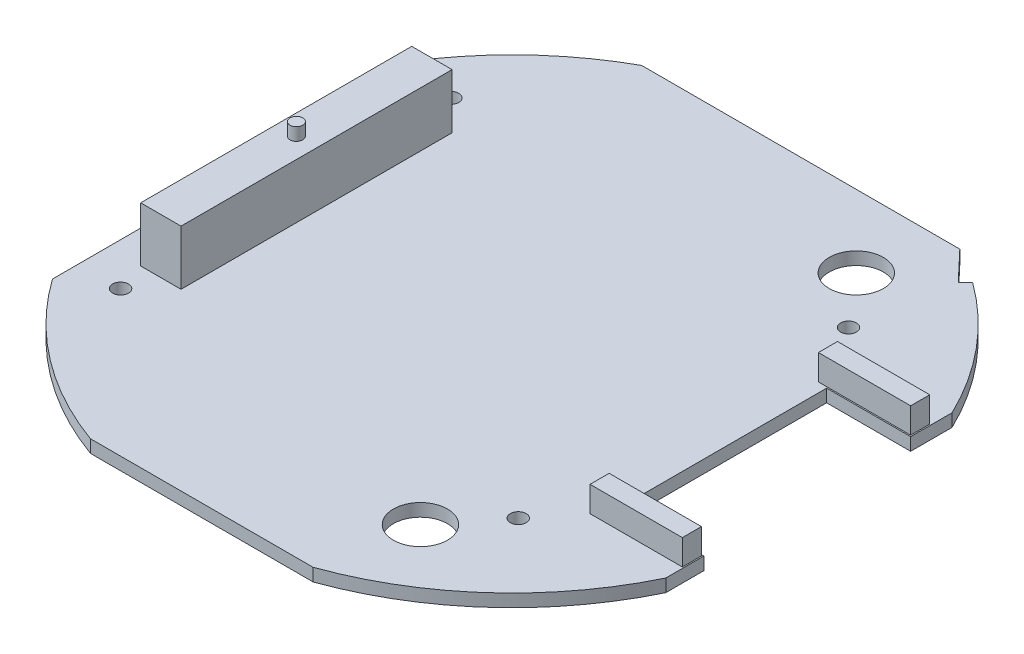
from build123d import *

# Parameters (mm, degrees)
SKETCH1_R           = 1.5875
BOSS_EXTRUDE1_DEPTH = 2.54
SKETCH2_W           = 8.0518
SKETCH2_H           = 54.102
BOSS_EXTRUDE2_DEPTH = 10.922
SKETCH3_W           = 18.415
SKETCH3_H           = 3.81
BOSS_EXTRUDE3_DEPTH = 5.08
SKETCH4_R           = 1.27
BOSS_EXTRUDE4_DEPTH = 2.54
SKETCH5_R           = 5.3975
CUT_EXTRUDE1_DEPTH  = 87.754479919


with BuildPart() as part:
    # Sketch1 → Boss-Extrude1 (new body)
    with BuildSketch(Plane(origin=(0, 0, 0), x_dir=(1, 0, 0), z_dir=(0, 1, 0))):
        with BuildLine():
            ThreePointArc((-31.75, 57.617144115), (-43.79121105, 49.093050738), (-53.630101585, 38.1))
            Line((-53.630101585, 38.1), (-53.630101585, 5.08))
            Line((-53.630101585, 5.08), (-51.090101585, 5.08))
            ThreePointArc((-51.090101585, 5.08), (-46.010101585, 0), (-51.090101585, -5.08))
            Line((-51.090101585, -5.08), (-53.630101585, -5.08))
            Line((-53.630101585, -5.08), (-53.630101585, -38.1))
            ThreePointArc((-53.630101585, -38.1), (-39.753291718, -52.416348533), (-22.225, -61.918068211))
            Line((-22.225, -61.918068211), (22.225, -61.918068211))
            ThreePointArc((22.225, -61.918068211), (44.019611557, -48.888358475), (59.255946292, -28.575))
            Line((59.255946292, -28.575), (59.255946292, -20.955))
            Line((59.255946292, -20.955), (42.491946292, -20.955))
            Line((42.491946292, -20.955), (42.491946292, 20.2946))
            Line((42.491946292, 20.2946), (59.255946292, 20.2946))
            Line((59.255946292, 20.2946), (59.255946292, 28.575))
            ThreePointArc((59.255946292, 28.575), (50.547472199, 42.104047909), (38.815437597, 53.114589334))
            Line((38.815437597, 53.114589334), (37.340398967, 51.716989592))
            Line((37.340398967, 51.716989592), (31.75, 57.617144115))
            Line((31.75, 57.617144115), (-31.75, 57.617144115))
        make_face()
        with Locations((-45.184601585, -32.9565)):
            Circle(SKETCH1_R, mode=Mode.SUBTRACT)
        with Locations((34.190398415, -32.9565)):
            Circle(SKETCH1_R, mode=Mode.SUBTRACT)
        with Locations((-45.184601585, 32.9565)):
            Circle(SKETCH1_R, mode=Mode.SUBTRACT)
        with Locations((34.190398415, 32.9565)):
            Circle(SKETCH1_R, mode=Mode.SUBTRACT)
    extrude(amount=BOSS_EXTRUDE1_DEPTH)

    # Sketch2 → Boss-Extrude2 (add)
    with BuildSketch(Plane(origin=(0, 2.54, 0), x_dir=(1, 0, 0), z_dir=(0, 1, 0))):
        with Locations((-43.051001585, 0)):
            Rectangle(SKETCH2_W, SKETCH2_H)
    extrude(amount=BOSS_EXTRUDE2_DEPTH)

    # Sketch3 → Boss-Extrude3 (add)
    with BuildSketch(Plane(origin=(0, 2.54, 0), x_dir=(1, 0, 0), z_dir=(0, 1, 0))):
        with Locations((49.794446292, 22.4536)):
            Rectangle(SKETCH3_W, SKETCH3_H)
        with Locations((49.794446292, -23.114)):
            Rectangle(SKETCH3_W, SKETCH3_H)
    extrude(amount=BOSS_EXTRUDE3_DEPTH)

    # Sketch4 → Boss-Extrude4 (add)
    with BuildSketch(Plane(origin=(0, 13.462, 0), x_dir=(1, 0, 0), z_dir=(0, 1, 0))):
        with Locations(Location((-43.051001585, 0, 0), (0, 0, 270))):
            Circle(SKETCH4_R)
    extrude(amount=BOSS_EXTRUDE4_DEPTH)

    # Sketch5 → Cut-Extrude1 (cut, through all)
    with BuildSketch(Plane(origin=(0, 2.54, 0), x_dir=(1, 0, 0), z_dir=(0, 1, 0))):
        with Locations(Location((25.537446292, 43.1673, 0), (0, 0, 270))):
            Circle(SKETCH5_R)
        with Locations(Location((25.537446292, -43.8277, 0), (0, 0, 270))):
            Circle(SKETCH5_R)
    extrude(amount=-CUT_EXTRUDE1_DEPTH, mode=Mode.SUBTRACT)


solid = part.part
